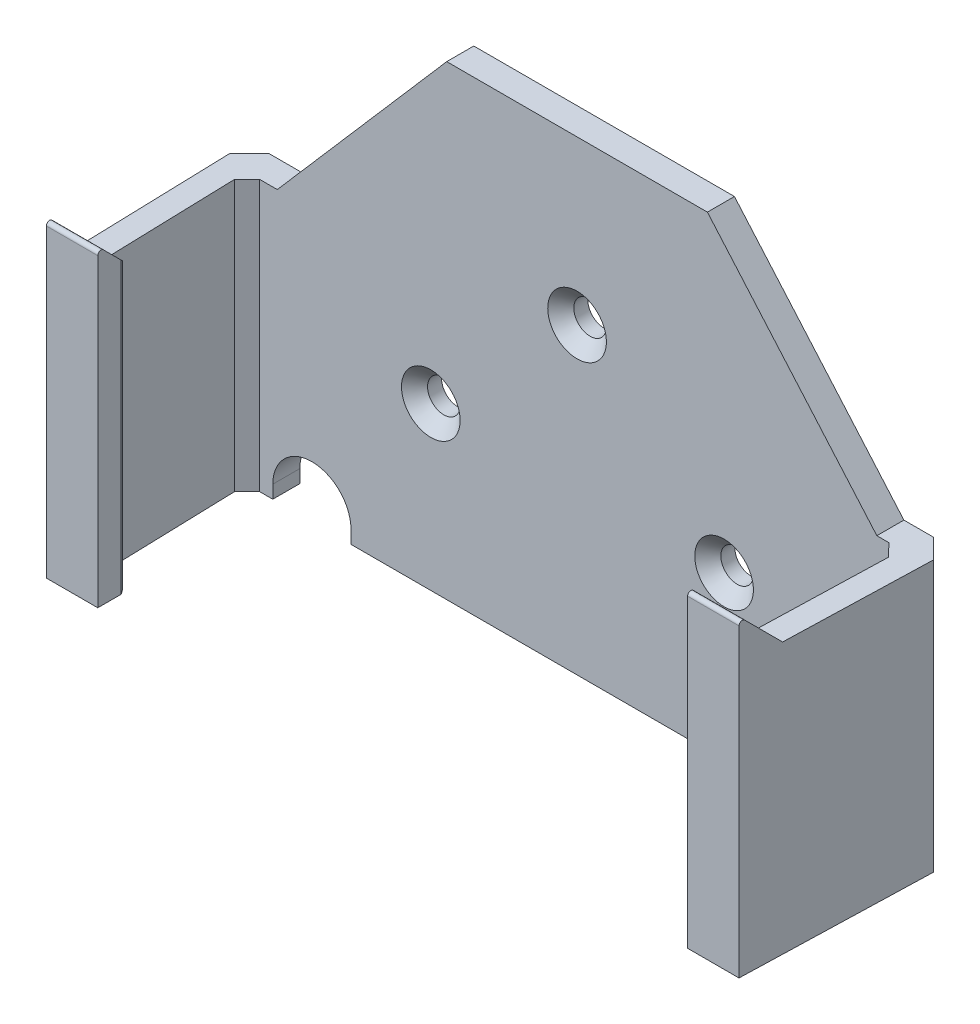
from build123d import *
from OCP.BRepFilletAPI import BRepFilletAPI_MakeChamfer

# Parameters (mm, degrees)
IZIM1_W                     = 108
IZIM1_H                     = 48
Y_KSEKLIK_EKSTR_ZYON1_DEPTH = 32
KES_EKSTR_ZYON1_DEPTH       = 119
PAH1_SIZE                   = 3
KES_EKSTR_ZYON2_DEPTH       = 116
RADYUS2_R                   = 0.5
KES_EKSTR_ZYON4_DEPTH       = 50
KES_EKSTR_ZYON5_DEPTH       = 4.25
IZIM8_R                     = 2.5
KES_EKSTR_ZYON6_DEPTH       = 10
PAH2_SIZE                   = 2
RADYUS4_R                   = 0.2
PAH3_SIZE                   = 2
PAH3_SIZE2                  = 1.943125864
Y_KSEKLIK_EKSTR_ZYON3_DEPTH = 4.149898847
IZIM11_R                    = 2.5
KES_EKSTR_ZYON7_DEPTH       = 9
PAH4_SIZE                   = 2


with BuildPart() as part:
    # izim1 → Y_kseklik-Ekstr_zyon1 (new body)
    with BuildSketch(Plane.XY):
        with Locations((54, 24)):
            Rectangle(IZIM1_W, IZIM1_H)
    extrude(amount=Y_KSEKLIK_EKSTR_ZYON1_DEPTH)

    # izim2 → Kes-Ekstr_zyon1 (cut)
    with BuildSketch(Plane(origin=(0, 48, 0), x_dir=(1, 0, 0), z_dir=(0, 1, 0))):
        Polygon((8.75, -32), (99.25, -32), (99.25, -28.42558078), (99.75, -27.699898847), (103.55, -27.699898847), (104.25, -4.149898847), (3.75, -4.149898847), (4.45, -27.699898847), (8.25, -27.699898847), (8.75, -28.42558078), align=None)
    extrude(amount=-KES_EKSTR_ZYON1_DEPTH, mode=Mode.SUBTRACT)

    # Pah1
    pah1_edges = [part.edges().sort_by_distance(p)[0] for p in [
        (108, 24, 0),
        (0, 24, 0),
    ]]
    chamfer(pah1_edges, length=PAH1_SIZE)

    # izim4 → Kes-Ekstr_zyon2 (cut)
    with BuildSketch(Plane.ZY):
        Polygon((32, 48), (25.5, 41.5), (0, 41.5), (0, 48), align=None)
    extrude(amount=-KES_EKSTR_ZYON2_DEPTH, mode=Mode.SUBTRACT)

    # Radyus2
    radyus2_edges = [part.edges().sort_by_distance(p)[0] for p in [
        (4.375, 48, 32),
        (103.625, 48, 32),
    ]]
    fillet(radyus2_edges, radius=RADYUS2_R)

    # izim6 → Kes-Ekstr_zyon4 (cut, symmetric)
    with BuildSketch(Plane(origin=(0, 41.5, 0), x_dir=(1, 0, 0), z_dir=(0, 1, 0))):
        Polygon((0, -3), (0.861995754, -32), (-3.705568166, -32), align=None)
        Polygon((111.705568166, -32), (108, -3), (107.138004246, -32), align=None)
    extrude(amount=KES_EKSTR_ZYON4_DEPTH, both=True, mode=Mode.SUBTRACT)

    # izim7 → Kes-Ekstr_zyon5 (cut)
    with BuildSketch(Plane(origin=(0, 0, 0), x_dir=(-1, 0, 0), z_dir=(0, 0, -1))):
        with BuildLine():
            Line((-100.75, 2), (-100.75, 0))
            Line((-100.75, 0), (-88.75, 0))
            Line((-88.75, 0), (-88.75, 2))
            ThreePointArc((-88.75, 2), (-94.75, 8), (-100.75, 2))
        make_face()
        with BuildLine():
            Line((-19.75, 2), (-19.75, 0))
            Line((-19.75, 0), (-7.75, 0))
            Line((-7.75, 0), (-7.75, 2))
            ThreePointArc((-7.75, 2), (-13.75, 8), (-19.75, 2))
        make_face()
    extrude(amount=-KES_EKSTR_ZYON5_DEPTH, mode=Mode.SUBTRACT)

    # izim8 → Kes-Ekstr_zyon6 (cut)
    with BuildSketch(Plane(origin=(0, 0, 0), x_dir=(-1, 0, 0), z_dir=(0, 0, -1))):
        with Locations((-77, 24.835138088)):
            Circle(IZIM8_R)
        with Locations((-32, 24.835138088)):
            Circle(IZIM8_R)
    extrude(amount=-KES_EKSTR_ZYON6_DEPTH, mode=Mode.SUBTRACT)

    # Pah2
    pah2_edges = [part.edges().sort_by_distance(p)[0] for p in [
        (79.5, 24.835138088, 4.149898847),
        (34.5, 24.835138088, 4.149898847),
    ]]
    chamfer(pah2_edges, length=PAH2_SIZE)

    # Radyus4
    radyus4_edges = [part.edges().sort_by_distance(p)[0] for p in [
        (103.55, 21.849949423, 27.699898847),
        (4.45, 21.849949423, 27.699898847),
    ]]
    fillet(radyus4_edges, radius=RADYUS4_R)

    # Pah3: one chamfer whose edges measure the first distance from different faces: ONE call of the kernel's chamfer builder (chamfer() names one face for all edges)
    pah3_edges_1 = [part.edges().sort_by_distance(p)[0] for p in [
        (3.75, 20.75, 4.149898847),
    ]]
    pah3_side_1 = [part.faces().sort_by_distance(p)[0] for p in [
        (53.973240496, 21.332318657, 4.149898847),
    ]]
    pah3_edges_2 = [part.edges().sort_by_distance(p)[0] for p in [
        (104.25, 20.75, 4.149898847),
    ]]
    pah3_side_2 = [part.faces().sort_by_distance(p)[0] for p in [
        (103.902206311, 20.794361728, 15.850672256),
    ]]
    pah3 = BRepFilletAPI_MakeChamfer(part.part.solid().wrapped)
    for e in pah3_edges_1:
        pah3.Add(PAH3_SIZE, PAH3_SIZE2, e.wrapped, pah3_side_1[0].wrapped)  # the first distance lies on this face
    for e in pah3_edges_2:
        pah3.Add(PAH3_SIZE, PAH3_SIZE2, e.wrapped, pah3_side_2[0].wrapped)  # the first distance lies on this face
    add(Compound.cast(pah3.Shape()), mode=Mode.REPLACE)

    # izim10 → Y_kseklik-Ekstr_zyon3 (add)
    with BuildSketch(Plane(origin=(0, 0, 0), x_dir=(-1, 0, 0), z_dir=(0, 0, -1))):
        Polygon((-100.440578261, 41.5), (-74.440578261, 71.5), (-34.440578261, 71.5), (-8.440578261, 41.5), align=None)
    extrude(amount=-Y_KSEKLIK_EKSTR_ZYON3_DEPTH)

    # izim11 → Kes-Ekstr_zyon7 (cut)
    with BuildSketch(Plane.XY.offset(4.149898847)):
        with Locations((54.440578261, 46.5)):
            Circle(IZIM11_R)
    extrude(amount=-KES_EKSTR_ZYON7_DEPTH, mode=Mode.SUBTRACT)

    # Pah4
    pah4_edges = [part.edges().sort_by_distance(p)[0] for p in [
        (51.940578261, 46.5, 4.149898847),
    ]]
    chamfer(pah4_edges, length=PAH4_SIZE)


solid = part.part
